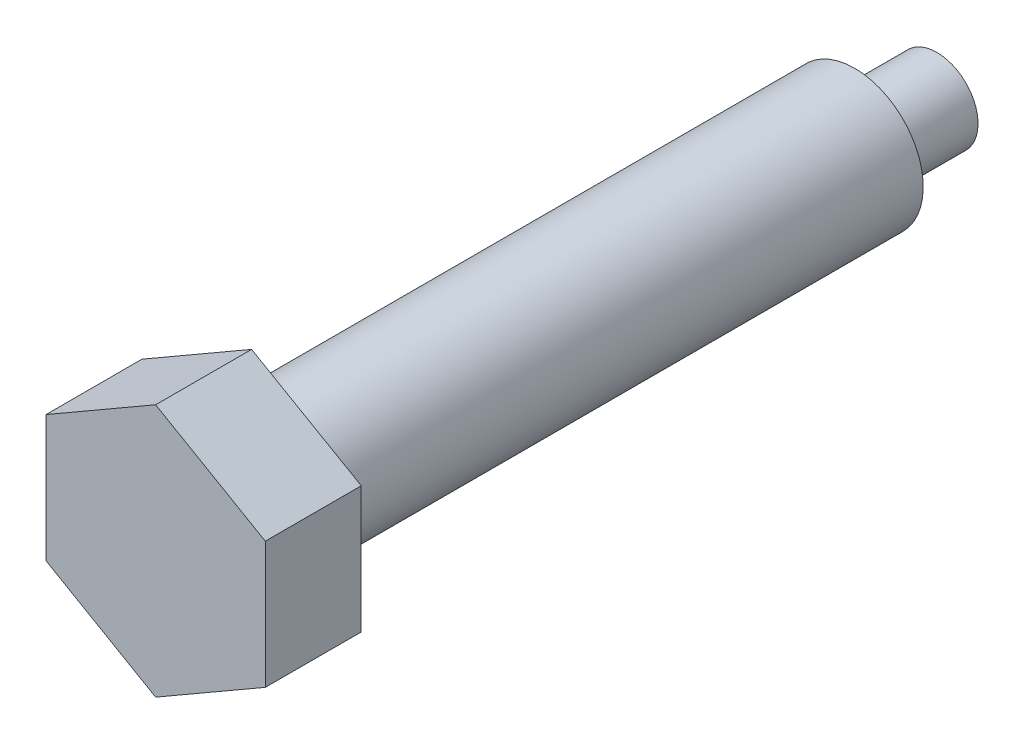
ISO-10303-21;
HEADER;
FILE_DESCRIPTION(('STEP AP214'),'2;1');
FILE_NAME('part.step','',(''),(''),'','','');
FILE_SCHEMA(('AUTOMOTIVE_DESIGN { 1 0 10303 214 1 1 1 1 }'));
ENDSEC;
DATA;
#1=APPLICATION_CONTEXT('core data for automotive mechanical design processes');
#2=APPLICATION_PROTOCOL_DEFINITION('international standard','automotive_design',2000,#1);
#3=PRODUCT_CONTEXT('',#1,'mechanical');
#4=PRODUCT('Part','Part','',(#3));
#5=PRODUCT_RELATED_PRODUCT_CATEGORY('part','',(#4));
#6=PRODUCT_DEFINITION_FORMATION('','',#4);
#7=PRODUCT_DEFINITION_CONTEXT('part definition',#1,'design');
#8=PRODUCT_DEFINITION('design','',#6,#7);
#9=PRODUCT_DEFINITION_SHAPE('','',#8);
#10=(LENGTH_UNIT() NAMED_UNIT(*) SI_UNIT(.MILLI.,.METRE.));
#11=(NAMED_UNIT(*) PLANE_ANGLE_UNIT() SI_UNIT($,.RADIAN.));
#12=(NAMED_UNIT(*) SI_UNIT($,.STERADIAN.) SOLID_ANGLE_UNIT());
#13=UNCERTAINTY_MEASURE_WITH_UNIT(LENGTH_MEASURE(1.E-05),#10,'distance_accuracy_value','');
#14=(GEOMETRIC_REPRESENTATION_CONTEXT(3) GLOBAL_UNCERTAINTY_ASSIGNED_CONTEXT((#13)) GLOBAL_UNIT_ASSIGNED_CONTEXT((#10,
#11,#12)) REPRESENTATION_CONTEXT('',''));
#15=CARTESIAN_POINT('',(0.,0.,0.));
#16=DIRECTION('',(0.,0.,1.));
#17=DIRECTION('',(1.,0.,0.));
#18=AXIS2_PLACEMENT_3D('',#15,#16,#17);
#19=CARTESIAN_POINT('',(0.,-4.61880215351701,0.));
#20=DIRECTION('',(0.,0.,1.));
#21=DIRECTION('',(0.,1.00000000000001,0.));
#22=AXIS2_PLACEMENT_3D('',#19,#20,#21);
#23=PLANE('',#22);
#24=DIRECTION('',(0.866025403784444,-0.50000000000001,0.));
#25=VECTOR('',#24,1.);
#26=CARTESIAN_POINT('',(-4.,-2.30940107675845,0.));
#27=LINE('',#26,#25);
#28=CARTESIAN_POINT('',(-4.,-2.30940107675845,0.));
#29=VERTEX_POINT('',#28);
#30=CARTESIAN_POINT('',(0.,-4.61880215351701,0.));
#31=VERTEX_POINT('',#30);
#32=EDGE_CURVE('E72',#29,#31,#27,.T.);
#33=ORIENTED_EDGE('',*,*,#32,.F.);
#34=DIRECTION('',(0.,-1.00000000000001,0.));
#35=VECTOR('',#34,1.);
#36=CARTESIAN_POINT('',(-4.,2.30940107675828,0.));
#37=LINE('',#36,#35);
#38=CARTESIAN_POINT('',(-4.,2.30940107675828,0.));
#39=VERTEX_POINT('',#38);
#40=EDGE_CURVE('E99',#39,#29,#37,.T.);
#41=ORIENTED_EDGE('',*,*,#40,.F.);
#42=DIRECTION('',(-0.866025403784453,-0.5,0.));
#43=VECTOR('',#42,1.);
#44=CARTESIAN_POINT('',(0.,4.61880215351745,0.));
#45=LINE('',#44,#43);
#46=CARTESIAN_POINT('',(0.,4.61880215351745,0.));
#47=VERTEX_POINT('',#46);
#48=EDGE_CURVE('E97',#47,#39,#45,.T.);
#49=ORIENTED_EDGE('',*,*,#48,.F.);
#50=DIRECTION('',(-0.866025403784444,0.50000000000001,0.));
#51=VECTOR('',#50,1.);
#52=CARTESIAN_POINT('',(4.00000000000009,2.30940107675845,0.));
#53=LINE('',#52,#51);
#54=CARTESIAN_POINT('',(4.00000000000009,2.30940107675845,0.));
#55=VERTEX_POINT('',#54);
#56=EDGE_CURVE('E95',#55,#47,#53,.T.);
#57=ORIENTED_EDGE('',*,*,#56,.F.);
#58=DIRECTION('',(0.,1.00000000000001,0.));
#59=VECTOR('',#58,1.);
#60=CARTESIAN_POINT('',(4.00000000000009,-2.30940107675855,0.));
#61=LINE('',#60,#59);
#62=CARTESIAN_POINT('',(4.00000000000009,-2.30940107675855,0.));
#63=VERTEX_POINT('',#62);
#64=EDGE_CURVE('E74',#63,#55,#61,.T.);
#65=ORIENTED_EDGE('',*,*,#64,.F.);
#66=DIRECTION('',(0.866025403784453,0.5,0.));
#67=VECTOR('',#66,1.);
#68=CARTESIAN_POINT('',(0.,-4.61880215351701,0.));
#69=LINE('',#68,#67);
#70=EDGE_CURVE('E67',#31,#63,#69,.T.);
#71=ORIENTED_EDGE('',*,*,#70,.F.);
#72=EDGE_LOOP('',(#33,#41,#49,#57,#65,#71));
#73=FACE_BOUND('',#72,.T.);
#74=CARTESIAN_POINT('',(0.,0.,0.));
#75=DIRECTION('',(0.,0.,1.));
#76=DIRECTION('',(0.,1.00000000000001,0.));
#77=AXIS2_PLACEMENT_3D('',#74,#75,#76);
#78=CIRCLE('',#77,2.5);
#79=CARTESIAN_POINT('',(0.,2.50000000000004,0.));
#80=VERTEX_POINT('',#79);
#81=EDGE_CURVE('E9',#80,#80,#78,.F.);
#82=ORIENTED_EDGE('',*,*,#81,.F.);
#83=EDGE_LOOP('',(#82));
#84=FACE_BOUND('',#83,.T.);
#85=ADVANCED_FACE('F14',(#73,#84),#23,.F.);
#86=CARTESIAN_POINT('',(-4.,-2.30940107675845,3.5));
#87=DIRECTION('',(0.50000000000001,0.866025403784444,0.));
#88=DIRECTION('',(-0.866025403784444,0.50000000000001,0.));
#89=AXIS2_PLACEMENT_3D('',#86,#87,#88);
#90=PLANE('',#89);
#91=ORIENTED_EDGE('',*,*,#32,.T.);
#92=DIRECTION('',(0.,0.,-1.));
#93=VECTOR('',#92,1.);
#94=CARTESIAN_POINT('',(0.,-4.61880215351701,3.5));
#95=LINE('',#94,#93);
#96=CARTESIAN_POINT('',(0.,-4.61880215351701,3.5));
#97=VERTEX_POINT('',#96);
#98=EDGE_CURVE('E22',#97,#31,#95,.T.);
#99=ORIENTED_EDGE('',*,*,#98,.F.);
#100=DIRECTION('',(0.866025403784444,-0.50000000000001,0.));
#101=VECTOR('',#100,1.);
#102=CARTESIAN_POINT('',(-4.,-2.30940107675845,3.5));
#103=LINE('',#102,#101);
#104=CARTESIAN_POINT('',(-4.,-2.30940107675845,3.5));
#105=VERTEX_POINT('',#104);
#106=EDGE_CURVE('E101',#105,#97,#103,.T.);
#107=ORIENTED_EDGE('',*,*,#106,.F.);
#108=DIRECTION('',(0.,0.,-1.));
#109=VECTOR('',#108,1.);
#110=CARTESIAN_POINT('',(-4.,-2.30940107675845,3.5));
#111=LINE('',#110,#109);
#112=EDGE_CURVE('E86',#105,#29,#111,.T.);
#113=ORIENTED_EDGE('',*,*,#112,.T.);
#114=EDGE_LOOP('',(#91,#99,#107,#113));
#115=FACE_BOUND('',#114,.T.);
#116=ADVANCED_FACE('F16',(#115),#90,.F.);
#117=CARTESIAN_POINT('',(0.,-4.61880215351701,3.5));
#118=DIRECTION('',(-0.5,0.866025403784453,0.));
#119=DIRECTION('',(-0.866025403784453,-0.5,0.));
#120=AXIS2_PLACEMENT_3D('',#117,#118,#119);
#121=PLANE('',#120);
#122=ORIENTED_EDGE('',*,*,#70,.T.);
#123=DIRECTION('',(0.,0.,-1.));
#124=VECTOR('',#123,1.);
#125=CARTESIAN_POINT('',(4.00000000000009,-2.30940107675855,3.5));
#126=LINE('',#125,#124);
#127=CARTESIAN_POINT('',(4.00000000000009,-2.30940107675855,3.5));
#128=VERTEX_POINT('',#127);
#129=EDGE_CURVE('E84',#128,#63,#126,.T.);
#130=ORIENTED_EDGE('',*,*,#129,.F.);
#131=DIRECTION('',(0.866025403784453,0.5,0.));
#132=VECTOR('',#131,1.);
#133=CARTESIAN_POINT('',(0.,-4.61880215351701,3.5));
#134=LINE('',#133,#132);
#135=EDGE_CURVE('E81',#97,#128,#134,.T.);
#136=ORIENTED_EDGE('',*,*,#135,.F.);
#137=ORIENTED_EDGE('',*,*,#98,.T.);
#138=EDGE_LOOP('',(#122,#130,#136,#137));
#139=FACE_BOUND('',#138,.T.);
#140=ADVANCED_FACE('F80',(#139),#121,.F.);
#141=CARTESIAN_POINT('',(4.00000000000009,-2.30940107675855,3.5));
#142=DIRECTION('',(-1.00000000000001,0.,0.));
#143=DIRECTION('',(0.,-1.00000000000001,0.));
#144=AXIS2_PLACEMENT_3D('',#141,#142,#143);
#145=PLANE('',#144);
#146=ORIENTED_EDGE('',*,*,#64,.T.);
#147=DIRECTION('',(0.,0.,-1.));
#148=VECTOR('',#147,1.);
#149=CARTESIAN_POINT('',(4.00000000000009,2.30940107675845,3.5));
#150=LINE('',#149,#148);
#151=CARTESIAN_POINT('',(4.00000000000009,2.30940107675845,3.5));
#152=VERTEX_POINT('',#151);
#153=EDGE_CURVE('E117',#152,#55,#150,.T.);
#154=ORIENTED_EDGE('',*,*,#153,.F.);
#155=DIRECTION('',(0.,1.00000000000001,0.));
#156=VECTOR('',#155,1.);
#157=CARTESIAN_POINT('',(4.00000000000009,-2.30940107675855,3.5));
#158=LINE('',#157,#156);
#159=EDGE_CURVE('E104',#128,#152,#158,.T.);
#160=ORIENTED_EDGE('',*,*,#159,.F.);
#161=ORIENTED_EDGE('',*,*,#129,.T.);
#162=EDGE_LOOP('',(#146,#154,#160,#161));
#163=FACE_BOUND('',#162,.T.);
#164=ADVANCED_FACE('F122',(#163),#145,.F.);
#165=CARTESIAN_POINT('',(4.00000000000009,2.30940107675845,3.5));
#166=DIRECTION('',(-0.50000000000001,-0.866025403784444,0.));
#167=DIRECTION('',(0.866025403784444,-0.50000000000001,0.));
#168=AXIS2_PLACEMENT_3D('',#165,#166,#167);
#169=PLANE('',#168);
#170=ORIENTED_EDGE('',*,*,#56,.T.);
#171=DIRECTION('',(0.,0.,-1.));
#172=VECTOR('',#171,1.);
#173=CARTESIAN_POINT('',(0.,4.61880215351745,3.5));
#174=LINE('',#173,#172);
#175=CARTESIAN_POINT('',(0.,4.61880215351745,3.5));
#176=VERTEX_POINT('',#175);
#177=EDGE_CURVE('E114',#176,#47,#174,.T.);
#178=ORIENTED_EDGE('',*,*,#177,.F.);
#179=DIRECTION('',(-0.866025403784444,0.50000000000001,0.));
#180=VECTOR('',#179,1.);
#181=CARTESIAN_POINT('',(4.00000000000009,2.30940107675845,3.5));
#182=LINE('',#181,#180);
#183=EDGE_CURVE('E106',#152,#176,#182,.T.);
#184=ORIENTED_EDGE('',*,*,#183,.F.);
#185=ORIENTED_EDGE('',*,*,#153,.T.);
#186=EDGE_LOOP('',(#170,#178,#184,#185));
#187=FACE_BOUND('',#186,.T.);
#188=ADVANCED_FACE('F128',(#187),#169,.F.);
#189=CARTESIAN_POINT('',(0.,4.61880215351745,3.5));
#190=DIRECTION('',(0.5,-0.866025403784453,0.));
#191=DIRECTION('',(0.866025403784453,0.5,0.));
#192=AXIS2_PLACEMENT_3D('',#189,#190,#191);
#193=PLANE('',#192);
#194=ORIENTED_EDGE('',*,*,#48,.T.);
#195=DIRECTION('',(0.,0.,-1.));
#196=VECTOR('',#195,1.);
#197=CARTESIAN_POINT('',(-4.,2.30940107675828,3.5));
#198=LINE('',#197,#196);
#199=CARTESIAN_POINT('',(-4.,2.30940107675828,3.5));
#200=VERTEX_POINT('',#199);
#201=EDGE_CURVE('E111',#200,#39,#198,.T.);
#202=ORIENTED_EDGE('',*,*,#201,.F.);
#203=DIRECTION('',(-0.866025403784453,-0.5,0.));
#204=VECTOR('',#203,1.);
#205=CARTESIAN_POINT('',(0.,4.61880215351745,3.5));
#206=LINE('',#205,#204);
#207=EDGE_CURVE('E34',#176,#200,#206,.T.);
#208=ORIENTED_EDGE('',*,*,#207,.F.);
#209=ORIENTED_EDGE('',*,*,#177,.T.);
#210=EDGE_LOOP('',(#194,#202,#208,#209));
#211=FACE_BOUND('',#210,.T.);
#212=ADVANCED_FACE('F131',(#211),#193,.F.);
#213=CARTESIAN_POINT('',(-4.,2.30940107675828,3.5));
#214=DIRECTION('',(1.00000000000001,0.,0.));
#215=DIRECTION('',(0.,1.00000000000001,0.));
#216=AXIS2_PLACEMENT_3D('',#213,#214,#215);
#217=PLANE('',#216);
#218=ORIENTED_EDGE('',*,*,#40,.T.);
#219=ORIENTED_EDGE('',*,*,#112,.F.);
#220=DIRECTION('',(0.,-1.00000000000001,0.));
#221=VECTOR('',#220,1.);
#222=CARTESIAN_POINT('',(-4.,2.30940107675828,3.5));
#223=LINE('',#222,#221);
#224=EDGE_CURVE('E29',#200,#105,#223,.T.);
#225=ORIENTED_EDGE('',*,*,#224,.F.);
#226=ORIENTED_EDGE('',*,*,#201,.T.);
#227=EDGE_LOOP('',(#218,#219,#225,#226));
#228=FACE_BOUND('',#227,.T.);
#229=ADVANCED_FACE('F133',(#228),#217,.F.);
#230=CARTESIAN_POINT('',(0.,-4.61880215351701,3.5));
#231=DIRECTION('',(0.,0.,1.));
#232=DIRECTION('',(0.,1.00000000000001,0.));
#233=AXIS2_PLACEMENT_3D('',#230,#231,#232);
#234=PLANE('',#233);
#235=ORIENTED_EDGE('',*,*,#106,.T.);
#236=ORIENTED_EDGE('',*,*,#135,.T.);
#237=ORIENTED_EDGE('',*,*,#159,.T.);
#238=ORIENTED_EDGE('',*,*,#183,.T.);
#239=ORIENTED_EDGE('',*,*,#207,.T.);
#240=ORIENTED_EDGE('',*,*,#224,.T.);
#241=EDGE_LOOP('',(#235,#236,#237,#238,#239,#240));
#242=FACE_BOUND('',#241,.T.);
#243=ADVANCED_FACE('F125',(#242),#234,.T.);
#244=CARTESIAN_POINT('',(0.,0.,0.));
#245=DIRECTION('',(0.,0.,1.));
#246=DIRECTION('',(0.,1.00000000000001,0.));
#247=AXIS2_PLACEMENT_3D('',#244,#245,#246);
#248=CYLINDRICAL_SURFACE('',#247,2.5);
#249=ORIENTED_EDGE('',*,*,#81,.T.);
#250=EDGE_LOOP('',(#249));
#251=FACE_BOUND('',#250,.T.);
#252=CARTESIAN_POINT('',(0.,0.,-22.));
#253=DIRECTION('',(0.,0.,1.));
#254=DIRECTION('',(0.,1.00000000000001,0.));
#255=AXIS2_PLACEMENT_3D('',#252,#253,#254);
#256=CIRCLE('',#255,2.5);
#257=CARTESIAN_POINT('',(0.,2.50000000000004,-22.));
#258=VERTEX_POINT('',#257);
#259=EDGE_CURVE('E87',#258,#258,#256,.T.);
#260=ORIENTED_EDGE('',*,*,#259,.T.);
#261=EDGE_LOOP('',(#260));
#262=FACE_BOUND('',#261,.T.);
#263=ADVANCED_FACE('F142',(#251,#262),#248,.T.);
#264=CARTESIAN_POINT('',(0.,0.,-22.5773502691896));
#265=DIRECTION('',(0.,0.,1.));
#266=DIRECTION('',(0.,1.00000000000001,0.));
#267=AXIS2_PLACEMENT_3D('',#264,#265,#266);
#268=CONICAL_SURFACE('',#267,1.5,1.0471975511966);
#269=ORIENTED_EDGE('',*,*,#259,.F.);
#270=EDGE_LOOP('',(#269));
#271=FACE_BOUND('',#270,.T.);
#272=CARTESIAN_POINT('',(0.,0.,-22.5773502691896));
#273=DIRECTION('',(0.,0.,1.));
#274=DIRECTION('',(0.,1.00000000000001,0.));
#275=AXIS2_PLACEMENT_3D('',#272,#273,#274);
#276=CIRCLE('',#275,1.5);
#277=CARTESIAN_POINT('',(0.,1.50000000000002,-22.5773502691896));
#278=VERTEX_POINT('',#277);
#279=EDGE_CURVE('E90',#278,#278,#276,.T.);
#280=ORIENTED_EDGE('',*,*,#279,.T.);
#281=EDGE_LOOP('',(#280));
#282=FACE_BOUND('',#281,.T.);
#283=ADVANCED_FACE('F154',(#271,#282),#268,.T.);
#284=CARTESIAN_POINT('',(0.,0.,0.));
#285=DIRECTION('',(0.,0.,1.));
#286=DIRECTION('',(0.,1.00000000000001,0.));
#287=AXIS2_PLACEMENT_3D('',#284,#285,#286);
#288=CYLINDRICAL_SURFACE('',#287,1.5);
#289=ORIENTED_EDGE('',*,*,#279,.F.);
#290=EDGE_LOOP('',(#289));
#291=FACE_BOUND('',#290,.T.);
#292=CARTESIAN_POINT('',(0.,0.,-25.));
#293=DIRECTION('',(0.,0.,1.));
#294=DIRECTION('',(0.,1.00000000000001,0.));
#295=AXIS2_PLACEMENT_3D('',#292,#293,#294);
#296=CIRCLE('',#295,1.5);
#297=CARTESIAN_POINT('',(0.,1.50000000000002,-25.));
#298=VERTEX_POINT('',#297);
#299=EDGE_CURVE('E171',#298,#298,#296,.T.);
#300=ORIENTED_EDGE('',*,*,#299,.T.);
#301=EDGE_LOOP('',(#300));
#302=FACE_BOUND('',#301,.T.);
#303=ADVANCED_FACE('F158',(#291,#302),#288,.T.);
#304=CARTESIAN_POINT('',(0.,0.,-21.2919007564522));
#305=DIRECTION('',(0.,0.,1.));
#306=DIRECTION('',(-1.00000000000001,0.,0.));
#307=AXIS2_PLACEMENT_3D('',#304,#305,#306);
#308=SPHERICAL_SURFACE('',#307,4.);
#309=ORIENTED_EDGE('',*,*,#299,.F.);
#310=EDGE_LOOP('',(#309));
#311=FACE_BOUND('',#310,.T.);
#312=ADVANCED_FACE('F162',(#311),#308,.T.);
#313=CLOSED_SHELL('',(#85,#116,#140,#164,#188,#212,#229,#243,#263,#283,#303,#312));
#314=MANIFOLD_SOLID_BREP('B1',#313);
#315=ADVANCED_BREP_SHAPE_REPRESENTATION('',(#18,#314),#14);
#316=SHAPE_DEFINITION_REPRESENTATION(#9,#315);
ENDSEC;
END-ISO-10303-21;
